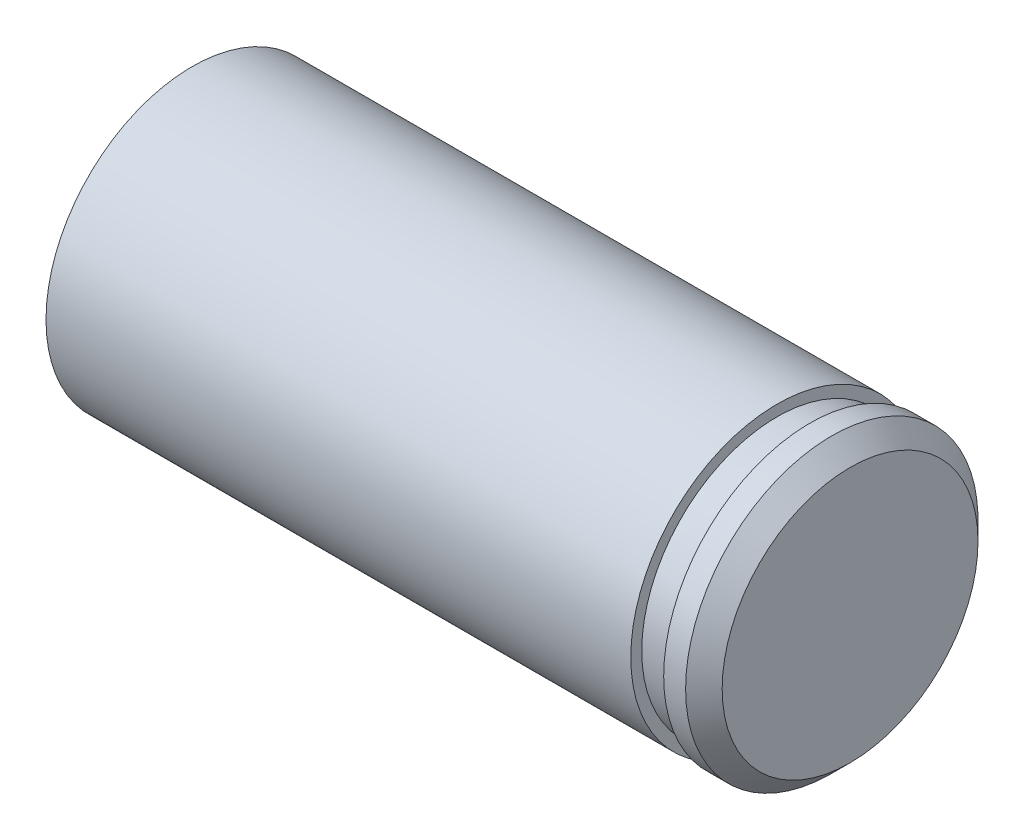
from build123d import *

# Parameters (mm, degrees)
TROU_TARAUD_M5X0_81_D     = 4.2
TROU_TARAUD_M5X0_81_DEPTH = 12
TROU_TARAUD_M5X0_81_TIP   = 1.212435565


with BuildPart() as part:
    # Esquisse1 → R_volution1 (revolve)
    with BuildSketch(Plane.XY, mode=Mode.PRIVATE) as r_volution1_sk:
        Polygon((0, 0), (0, 4), (16, 4), (16, 3.7), (16.9, 3.7), (16.9, 4), (17.5, 4), (18, 3.5), (18, 0), align=None)
    revolve(r_volution1_sk.sketch.rotate(Axis((-21.246309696, 0, 0), (1, 0, 0)), 90), axis=Axis((-21.246309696, 0, 0), (1, 0, 0)))

    # Trou taraud_ M5x0.81
    with Locations(Plane.ZY):
        with Locations((0, 0)):
            Hole(TROU_TARAUD_M5X0_81_D / 2, depth=TROU_TARAUD_M5X0_81_DEPTH)
            with Locations((0, 0, -(TROU_TARAUD_M5X0_81_DEPTH + TROU_TARAUD_M5X0_81_TIP / 2))):  # 120° drill point
                Cone(0, TROU_TARAUD_M5X0_81_D / 2, TROU_TARAUD_M5X0_81_TIP, mode=Mode.SUBTRACT)


solid = part.part
